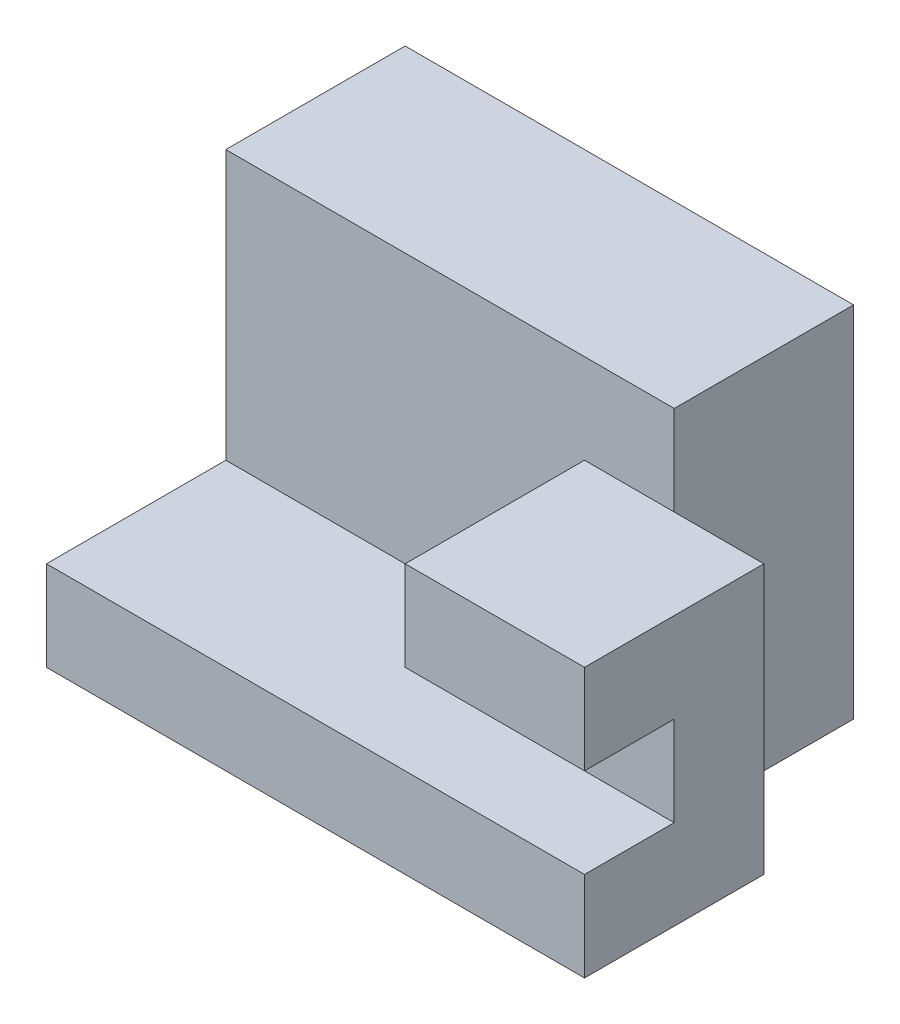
from build123d import *

# Parameters (mm, degrees)
EXTRUDE1_DEPTH = 50
EXTRUDE2_DEPTH = 10


with BuildPart() as part:
    # Sketch1 → Extrude1 (new body)
    with BuildSketch(Plane(origin=(0, 0, 0), x_dir=(0, 0, -1), z_dir=(1, 0, 0))):
        Polygon((-20, 0), (0, 0), (0, 40), (-20, 40), (-20, 30), (-20, 10), align=None)
        Polygon((-40, 0), (-20, 0), (-20, 10), (-30, 10), (-40, 10), align=None)
    extrude(amount=-EXTRUDE1_DEPTH)

    # Sketch → Extrude2 (add, symmetric)
    with BuildSketch(Plane(origin=(0, 0, 0), x_dir=(0, 0, -1), z_dir=(1, 0, 0))):
        Polygon((-20, 10), (-30, 10), (-30, 20), (-40, 20), (-40, 30), (-20, 30), align=None)
        Polygon((-40, 0), (-20, 0), (-20, 10), (-30, 10), (-40, 10), align=None)
    extrude(amount=EXTRUDE2_DEPTH, both=True)


solid = part.part
